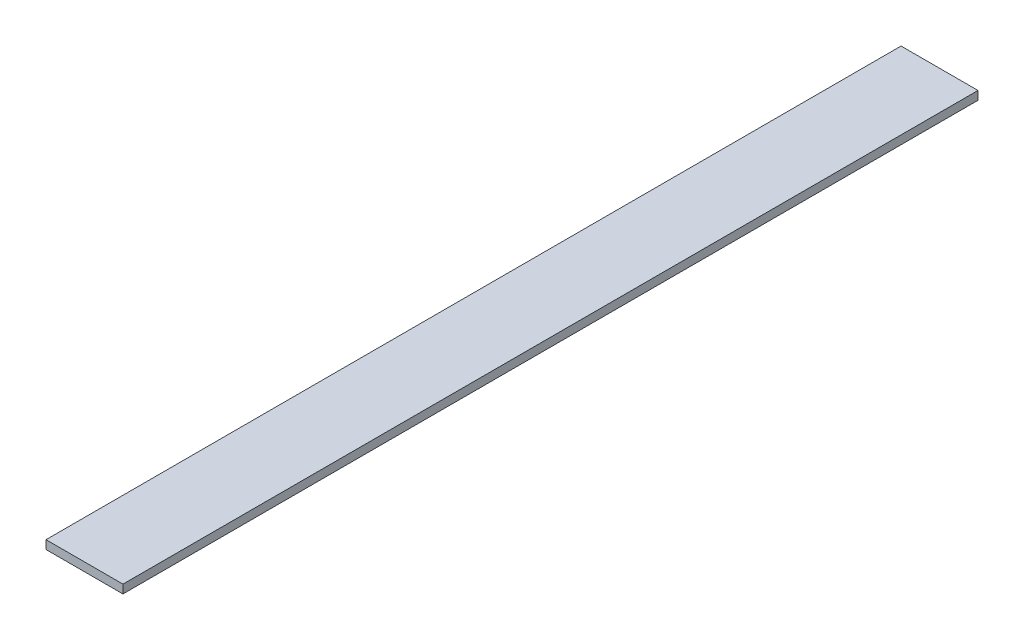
ISO-10303-21;
HEADER;
FILE_DESCRIPTION(('STEP AP214'),'2;1');
FILE_NAME('part.step','',(''),(''),'','','');
FILE_SCHEMA(('AUTOMOTIVE_DESIGN { 1 0 10303 214 1 1 1 1 }'));
ENDSEC;
DATA;
#1=APPLICATION_CONTEXT('core data for automotive mechanical design processes');
#2=APPLICATION_PROTOCOL_DEFINITION('international standard','automotive_design',2000,#1);
#3=PRODUCT_CONTEXT('',#1,'mechanical');
#4=PRODUCT('Part','Part','',(#3));
#5=PRODUCT_RELATED_PRODUCT_CATEGORY('part','',(#4));
#6=PRODUCT_DEFINITION_FORMATION('','',#4);
#7=PRODUCT_DEFINITION_CONTEXT('part definition',#1,'design');
#8=PRODUCT_DEFINITION('design','',#6,#7);
#9=PRODUCT_DEFINITION_SHAPE('','',#8);
#10=(LENGTH_UNIT() NAMED_UNIT(*) SI_UNIT(.MILLI.,.METRE.));
#11=(NAMED_UNIT(*) PLANE_ANGLE_UNIT() SI_UNIT($,.RADIAN.));
#12=(NAMED_UNIT(*) SI_UNIT($,.STERADIAN.) SOLID_ANGLE_UNIT());
#13=UNCERTAINTY_MEASURE_WITH_UNIT(LENGTH_MEASURE(1.E-05),#10,'distance_accuracy_value','');
#14=(GEOMETRIC_REPRESENTATION_CONTEXT(3) GLOBAL_UNCERTAINTY_ASSIGNED_CONTEXT((#13)) GLOBAL_UNIT_ASSIGNED_CONTEXT((#10,
#11,#12)) REPRESENTATION_CONTEXT('',''));
#15=CARTESIAN_POINT('',(0.,0.,0.));
#16=DIRECTION('',(0.,0.,1.));
#17=DIRECTION('',(1.,0.,0.));
#18=AXIS2_PLACEMENT_3D('',#15,#16,#17);
#19=CARTESIAN_POINT('',(22.5,0.,0.));
#20=DIRECTION('',(-1.,0.,0.));
#21=DIRECTION('',(0.,0.,1.));
#22=AXIS2_PLACEMENT_3D('',#19,#20,#21);
#23=PLANE('',#22);
#24=DIRECTION('',(0.,-1.,0.));
#25=VECTOR('',#24,1.);
#26=CARTESIAN_POINT('',(22.5,2.5,0.));
#27=LINE('',#26,#25);
#28=CARTESIAN_POINT('',(22.5,5.,0.));
#29=VERTEX_POINT('',#28);
#30=CARTESIAN_POINT('',(22.5,0.,0.));
#31=VERTEX_POINT('',#30);
#32=EDGE_CURVE('E51',#29,#31,#27,.T.);
#33=ORIENTED_EDGE('',*,*,#32,.F.);
#34=DIRECTION('',(0.,0.,-1.));
#35=VECTOR('',#34,1.);
#36=CARTESIAN_POINT('',(22.5,5.,250.));
#37=LINE('',#36,#35);
#38=CARTESIAN_POINT('',(22.5,5.,500.));
#39=VERTEX_POINT('',#38);
#40=EDGE_CURVE('E66',#39,#29,#37,.T.);
#41=ORIENTED_EDGE('',*,*,#40,.F.);
#42=DIRECTION('',(0.,-1.,0.));
#43=VECTOR('',#42,1.);
#44=CARTESIAN_POINT('',(22.5,2.5,500.));
#45=LINE('',#44,#43);
#46=CARTESIAN_POINT('',(22.5,0.,500.));
#47=VERTEX_POINT('',#46);
#48=EDGE_CURVE('E18',#39,#47,#45,.T.);
#49=ORIENTED_EDGE('',*,*,#48,.T.);
#50=DIRECTION('',(0.,0.,1.));
#51=VECTOR('',#50,1.);
#52=CARTESIAN_POINT('',(22.5,0.,250.));
#53=LINE('',#52,#51);
#54=EDGE_CURVE('E56',#31,#47,#53,.T.);
#55=ORIENTED_EDGE('',*,*,#54,.F.);
#56=EDGE_LOOP('',(#33,#41,#49,#55));
#57=FACE_BOUND('',#56,.T.);
#58=ADVANCED_FACE('F14',(#57),#23,.F.);
#59=CARTESIAN_POINT('',(22.5,0.,500.));
#60=DIRECTION('',(0.,0.,-1.));
#61=DIRECTION('',(-1.,0.,0.));
#62=AXIS2_PLACEMENT_3D('',#59,#60,#61);
#63=PLANE('',#62);
#64=DIRECTION('',(-1.,0.,0.));
#65=VECTOR('',#64,1.);
#66=CARTESIAN_POINT('',(0.,0.,500.));
#67=LINE('',#66,#65);
#68=CARTESIAN_POINT('',(-22.5,0.,500.));
#69=VERTEX_POINT('',#68);
#70=EDGE_CURVE('E61',#47,#69,#67,.T.);
#71=ORIENTED_EDGE('',*,*,#70,.F.);
#72=ORIENTED_EDGE('',*,*,#48,.F.);
#73=DIRECTION('',(1.,0.,0.));
#74=VECTOR('',#73,1.);
#75=CARTESIAN_POINT('',(0.,5.,500.));
#76=LINE('',#75,#74);
#77=CARTESIAN_POINT('',(-22.5,5.,500.));
#78=VERTEX_POINT('',#77);
#79=EDGE_CURVE('E79',#78,#39,#76,.T.);
#80=ORIENTED_EDGE('',*,*,#79,.F.);
#81=DIRECTION('',(0.,-1.,0.));
#82=VECTOR('',#81,1.);
#83=CARTESIAN_POINT('',(-22.5,2.5,500.));
#84=LINE('',#83,#82);
#85=EDGE_CURVE('E72',#78,#69,#84,.T.);
#86=ORIENTED_EDGE('',*,*,#85,.T.);
#87=EDGE_LOOP('',(#71,#72,#80,#86));
#88=FACE_BOUND('',#87,.T.);
#89=ADVANCED_FACE('F71',(#88),#63,.F.);
#90=CARTESIAN_POINT('',(-22.5,0.,500.));
#91=DIRECTION('',(0.,-1.,0.));
#92=DIRECTION('',(0.,0.,-1.));
#93=AXIS2_PLACEMENT_3D('',#90,#91,#92);
#94=PLANE('',#93);
#95=ORIENTED_EDGE('',*,*,#70,.T.);
#96=DIRECTION('',(0.,0.,-1.));
#97=VECTOR('',#96,1.);
#98=CARTESIAN_POINT('',(-22.5,0.,250.));
#99=LINE('',#98,#97);
#100=CARTESIAN_POINT('',(-22.5,0.,0.));
#101=VERTEX_POINT('',#100);
#102=EDGE_CURVE('E82',#69,#101,#99,.T.);
#103=ORIENTED_EDGE('',*,*,#102,.T.);
#104=DIRECTION('',(-1.,0.,0.));
#105=VECTOR('',#104,1.);
#106=CARTESIAN_POINT('',(0.,0.,0.));
#107=LINE('',#106,#105);
#108=EDGE_CURVE('E63',#31,#101,#107,.T.);
#109=ORIENTED_EDGE('',*,*,#108,.F.);
#110=ORIENTED_EDGE('',*,*,#54,.T.);
#111=EDGE_LOOP('',(#95,#103,#109,#110));
#112=FACE_BOUND('',#111,.T.);
#113=ADVANCED_FACE('F58',(#112),#94,.T.);
#114=CARTESIAN_POINT('',(22.5,0.,0.));
#115=DIRECTION('',(0.,0.,-1.));
#116=DIRECTION('',(-1.,0.,0.));
#117=AXIS2_PLACEMENT_3D('',#114,#115,#116);
#118=PLANE('',#117);
#119=ORIENTED_EDGE('',*,*,#32,.T.);
#120=ORIENTED_EDGE('',*,*,#108,.T.);
#121=DIRECTION('',(0.,1.,0.));
#122=VECTOR('',#121,1.);
#123=CARTESIAN_POINT('',(-22.5,2.5,0.));
#124=LINE('',#123,#122);
#125=CARTESIAN_POINT('',(-22.5,5.,0.));
#126=VERTEX_POINT('',#125);
#127=EDGE_CURVE('E24',#101,#126,#124,.T.);
#128=ORIENTED_EDGE('',*,*,#127,.T.);
#129=DIRECTION('',(-1.,0.,0.));
#130=VECTOR('',#129,1.);
#131=CARTESIAN_POINT('',(0.,5.,0.));
#132=LINE('',#131,#130);
#133=EDGE_CURVE('E32',#29,#126,#132,.T.);
#134=ORIENTED_EDGE('',*,*,#133,.F.);
#135=EDGE_LOOP('',(#119,#120,#128,#134));
#136=FACE_BOUND('',#135,.T.);
#137=ADVANCED_FACE('F86',(#136),#118,.T.);
#138=CARTESIAN_POINT('',(22.5,5.,0.));
#139=DIRECTION('',(0.,1.,0.));
#140=DIRECTION('',(-1.,0.,0.));
#141=AXIS2_PLACEMENT_3D('',#138,#139,#140);
#142=PLANE('',#141);
#143=DIRECTION('',(0.,0.,1.));
#144=VECTOR('',#143,1.);
#145=CARTESIAN_POINT('',(-22.5,5.,250.));
#146=LINE('',#145,#144);
#147=EDGE_CURVE('E9',#126,#78,#146,.T.);
#148=ORIENTED_EDGE('',*,*,#147,.T.);
#149=ORIENTED_EDGE('',*,*,#79,.T.);
#150=ORIENTED_EDGE('',*,*,#40,.T.);
#151=ORIENTED_EDGE('',*,*,#133,.T.);
#152=EDGE_LOOP('',(#148,#149,#150,#151));
#153=FACE_BOUND('',#152,.T.);
#154=ADVANCED_FACE('F88',(#153),#142,.T.);
#155=CARTESIAN_POINT('',(-22.5,0.,500.));
#156=DIRECTION('',(1.,0.,0.));
#157=DIRECTION('',(0.,0.,-1.));
#158=AXIS2_PLACEMENT_3D('',#155,#156,#157);
#159=PLANE('',#158);
#160=ORIENTED_EDGE('',*,*,#127,.F.);
#161=ORIENTED_EDGE('',*,*,#102,.F.);
#162=ORIENTED_EDGE('',*,*,#85,.F.);
#163=ORIENTED_EDGE('',*,*,#147,.F.);
#164=EDGE_LOOP('',(#160,#161,#162,#163));
#165=FACE_BOUND('',#164,.T.);
#166=ADVANCED_FACE('F16',(#165),#159,.F.);
#167=CLOSED_SHELL('',(#58,#89,#113,#137,#154,#166));
#168=MANIFOLD_SOLID_BREP('B1',#167);
#169=ADVANCED_BREP_SHAPE_REPRESENTATION('',(#18,#168),#14);
#170=SHAPE_DEFINITION_REPRESENTATION(#9,#169);
ENDSEC;
END-ISO-10303-21;
